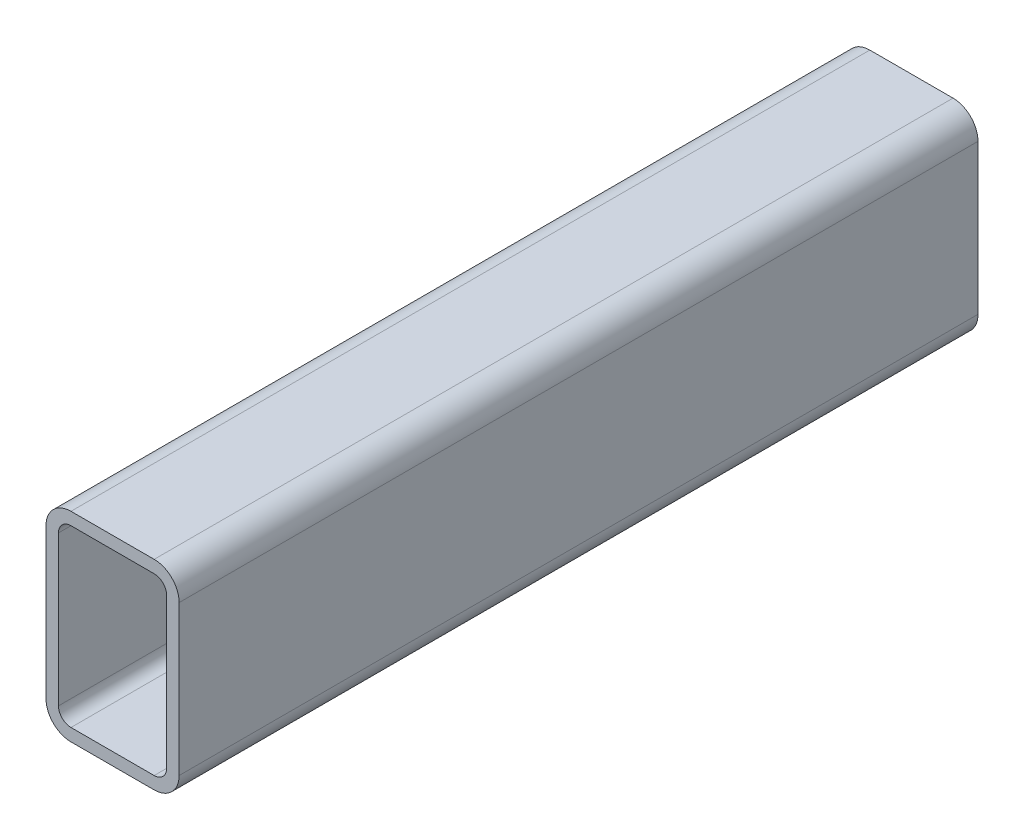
ISO-10303-21;
HEADER;
FILE_DESCRIPTION(('STEP AP214'),'2;1');
FILE_NAME('part.step','',(''),(''),'','','');
FILE_SCHEMA(('AUTOMOTIVE_DESIGN { 1 0 10303 214 1 1 1 1 }'));
ENDSEC;
DATA;
#1=APPLICATION_CONTEXT('core data for automotive mechanical design processes');
#2=APPLICATION_PROTOCOL_DEFINITION('international standard','automotive_design',2000,#1);
#3=PRODUCT_CONTEXT('',#1,'mechanical');
#4=PRODUCT('Part','Part','',(#3));
#5=PRODUCT_RELATED_PRODUCT_CATEGORY('part','',(#4));
#6=PRODUCT_DEFINITION_FORMATION('','',#4);
#7=PRODUCT_DEFINITION_CONTEXT('part definition',#1,'design');
#8=PRODUCT_DEFINITION('design','',#6,#7);
#9=PRODUCT_DEFINITION_SHAPE('','',#8);
#10=(LENGTH_UNIT() NAMED_UNIT(*) SI_UNIT(.MILLI.,.METRE.));
#11=(NAMED_UNIT(*) PLANE_ANGLE_UNIT() SI_UNIT($,.RADIAN.));
#12=(NAMED_UNIT(*) SI_UNIT($,.STERADIAN.) SOLID_ANGLE_UNIT());
#13=UNCERTAINTY_MEASURE_WITH_UNIT(LENGTH_MEASURE(1.E-05),#10,'distance_accuracy_value','');
#14=(GEOMETRIC_REPRESENTATION_CONTEXT(3) GLOBAL_UNCERTAINTY_ASSIGNED_CONTEXT((#13)) GLOBAL_UNIT_ASSIGNED_CONTEXT((#10,
#11,#12)) REPRESENTATION_CONTEXT('',''));
#15=CARTESIAN_POINT('',(0.,0.,0.));
#16=DIRECTION('',(0.,0.,1.));
#17=DIRECTION('',(1.,0.,0.));
#18=AXIS2_PLACEMENT_3D('',#15,#16,#17);
#19=CARTESIAN_POINT('',(9.525,66.675,304.8));
#20=DIRECTION('',(0.,0.,1.));
#21=DIRECTION('',(1.,0.,0.));
#22=AXIS2_PLACEMENT_3D('',#19,#20,#21);
#23=PLANE('',#22);
#24=CARTESIAN_POINT('',(9.525,66.675,304.8));
#25=DIRECTION('',(0.,0.,1.));
#26=DIRECTION('',(1.,0.,0.));
#27=AXIS2_PLACEMENT_3D('',#24,#25,#26);
#28=CIRCLE('',#27,9.52500000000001);
#29=CARTESIAN_POINT('',(9.525,76.2,304.8));
#30=VERTEX_POINT('',#29);
#31=CARTESIAN_POINT('',(0.,66.675,304.8));
#32=VERTEX_POINT('',#31);
#33=EDGE_CURVE('E211',#30,#32,#28,.T.);
#34=ORIENTED_EDGE('',*,*,#33,.T.);
#35=DIRECTION('',(0.,-1.,0.));
#36=VECTOR('',#35,1.);
#37=CARTESIAN_POINT('',(0.,9.525,304.8));
#38=LINE('',#37,#36);
#39=CARTESIAN_POINT('',(0.,9.525,304.8));
#40=VERTEX_POINT('',#39);
#41=EDGE_CURVE('E214',#32,#40,#38,.T.);
#42=ORIENTED_EDGE('',*,*,#41,.T.);
#43=CARTESIAN_POINT('',(9.525,9.525,304.8));
#44=DIRECTION('',(0.,0.,1.));
#45=DIRECTION('',(1.,0.,0.));
#46=AXIS2_PLACEMENT_3D('',#43,#44,#45);
#47=CIRCLE('',#46,9.525);
#48=CARTESIAN_POINT('',(9.525,0.,304.8));
#49=VERTEX_POINT('',#48);
#50=EDGE_CURVE('E217',#40,#49,#47,.T.);
#51=ORIENTED_EDGE('',*,*,#50,.T.);
#52=DIRECTION('',(1.,0.,0.));
#53=VECTOR('',#52,1.);
#54=CARTESIAN_POINT('',(41.275,0.,304.8));
#55=LINE('',#54,#53);
#56=CARTESIAN_POINT('',(41.275,0.,304.8));
#57=VERTEX_POINT('',#56);
#58=EDGE_CURVE('E219',#49,#57,#55,.T.);
#59=ORIENTED_EDGE('',*,*,#58,.T.);
#60=CARTESIAN_POINT('',(41.275,9.525,304.8));
#61=DIRECTION('',(0.,0.,1.));
#62=DIRECTION('',(1.,0.,0.));
#63=AXIS2_PLACEMENT_3D('',#60,#61,#62);
#64=CIRCLE('',#63,9.525);
#65=CARTESIAN_POINT('',(50.8,9.525,304.8));
#66=VERTEX_POINT('',#65);
#67=EDGE_CURVE('E221',#57,#66,#64,.T.);
#68=ORIENTED_EDGE('',*,*,#67,.T.);
#69=DIRECTION('',(0.,1.,0.));
#70=VECTOR('',#69,1.);
#71=CARTESIAN_POINT('',(50.8,66.675,304.8));
#72=LINE('',#71,#70);
#73=CARTESIAN_POINT('',(50.8,66.675,304.8));
#74=VERTEX_POINT('',#73);
#75=EDGE_CURVE('E223',#66,#74,#72,.T.);
#76=ORIENTED_EDGE('',*,*,#75,.T.);
#77=CARTESIAN_POINT('',(41.275,66.675,304.8));
#78=DIRECTION('',(0.,0.,1.));
#79=DIRECTION('',(1.,0.,0.));
#80=AXIS2_PLACEMENT_3D('',#77,#78,#79);
#81=CIRCLE('',#80,9.52500000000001);
#82=CARTESIAN_POINT('',(41.275,76.2,304.8));
#83=VERTEX_POINT('',#82);
#84=EDGE_CURVE('E225',#74,#83,#81,.T.);
#85=ORIENTED_EDGE('',*,*,#84,.T.);
#86=DIRECTION('',(-1.,0.,0.));
#87=VECTOR('',#86,1.);
#88=CARTESIAN_POINT('',(9.525,76.2,304.8));
#89=LINE('',#88,#87);
#90=EDGE_CURVE('E227',#83,#30,#89,.T.);
#91=ORIENTED_EDGE('',*,*,#90,.T.);
#92=EDGE_LOOP('',(#34,#42,#51,#59,#68,#76,#85,#91));
#93=FACE_BOUND('',#92,.T.);
#94=DIRECTION('',(0.,-1.,0.));
#95=VECTOR('',#94,1.);
#96=CARTESIAN_POINT('',(4.7625,9.525,304.8));
#97=LINE('',#96,#95);
#98=CARTESIAN_POINT('',(4.7625,66.675,304.8));
#99=VERTEX_POINT('',#98);
#100=CARTESIAN_POINT('',(4.7625,9.525,304.8));
#101=VERTEX_POINT('',#100);
#102=EDGE_CURVE('E154',#99,#101,#97,.T.);
#103=ORIENTED_EDGE('',*,*,#102,.F.);
#104=CARTESIAN_POINT('',(9.525,66.675,304.8));
#105=DIRECTION('',(0.,0.,1.));
#106=DIRECTION('',(1.,0.,0.));
#107=AXIS2_PLACEMENT_3D('',#104,#105,#106);
#108=CIRCLE('',#107,4.7625);
#109=CARTESIAN_POINT('',(9.525,71.4375,304.8));
#110=VERTEX_POINT('',#109);
#111=EDGE_CURVE('E146',#110,#99,#108,.T.);
#112=ORIENTED_EDGE('',*,*,#111,.F.);
#113=DIRECTION('',(-1.,0.,0.));
#114=VECTOR('',#113,1.);
#115=CARTESIAN_POINT('',(9.525,71.4375,304.8));
#116=LINE('',#115,#114);
#117=CARTESIAN_POINT('',(41.275,71.4375,304.8));
#118=VERTEX_POINT('',#117);
#119=EDGE_CURVE('E179',#118,#110,#116,.T.);
#120=ORIENTED_EDGE('',*,*,#119,.F.);
#121=CARTESIAN_POINT('',(41.275,66.675,304.8));
#122=DIRECTION('',(0.,0.,1.));
#123=DIRECTION('',(1.,0.,0.));
#124=AXIS2_PLACEMENT_3D('',#121,#122,#123);
#125=CIRCLE('',#124,4.7625);
#126=CARTESIAN_POINT('',(46.0375,66.675,304.8));
#127=VERTEX_POINT('',#126);
#128=EDGE_CURVE('E177',#127,#118,#125,.T.);
#129=ORIENTED_EDGE('',*,*,#128,.F.);
#130=DIRECTION('',(0.,1.,0.));
#131=VECTOR('',#130,1.);
#132=CARTESIAN_POINT('',(46.0375,66.675,304.8));
#133=LINE('',#132,#131);
#134=CARTESIAN_POINT('',(46.0375,9.525,304.8));
#135=VERTEX_POINT('',#134);
#136=EDGE_CURVE('E175',#135,#127,#133,.T.);
#137=ORIENTED_EDGE('',*,*,#136,.F.);
#138=CARTESIAN_POINT('',(41.275,9.525,304.8));
#139=DIRECTION('',(0.,0.,1.));
#140=DIRECTION('',(1.,0.,0.));
#141=AXIS2_PLACEMENT_3D('',#138,#139,#140);
#142=CIRCLE('',#141,4.7625);
#143=CARTESIAN_POINT('',(41.275,4.7625,304.8));
#144=VERTEX_POINT('',#143);
#145=EDGE_CURVE('E173',#144,#135,#142,.T.);
#146=ORIENTED_EDGE('',*,*,#145,.F.);
#147=DIRECTION('',(1.,0.,0.));
#148=VECTOR('',#147,1.);
#149=CARTESIAN_POINT('',(41.275,4.7625,304.8));
#150=LINE('',#149,#148);
#151=CARTESIAN_POINT('',(9.525,4.7625,304.8));
#152=VERTEX_POINT('',#151);
#153=EDGE_CURVE('E169',#152,#144,#150,.T.);
#154=ORIENTED_EDGE('',*,*,#153,.F.);
#155=CARTESIAN_POINT('',(9.525,9.525,304.8));
#156=DIRECTION('',(0.,0.,1.));
#157=DIRECTION('',(1.,0.,0.));
#158=AXIS2_PLACEMENT_3D('',#155,#156,#157);
#159=CIRCLE('',#158,4.7625);
#160=EDGE_CURVE('E167',#101,#152,#159,.T.);
#161=ORIENTED_EDGE('',*,*,#160,.F.);
#162=EDGE_LOOP('',(#103,#112,#120,#129,#137,#146,#154,#161));
#163=FACE_BOUND('',#162,.T.);
#164=ADVANCED_FACE('F33',(#93,#163),#23,.T.);
#165=CARTESIAN_POINT('',(9.525,66.675,0.));
#166=DIRECTION('',(0.,0.,1.));
#167=DIRECTION('',(1.,0.,0.));
#168=AXIS2_PLACEMENT_3D('',#165,#166,#167);
#169=PLANE('',#168);
#170=CARTESIAN_POINT('',(9.525,66.675,0.));
#171=DIRECTION('',(0.,0.,1.));
#172=DIRECTION('',(1.,0.,0.));
#173=AXIS2_PLACEMENT_3D('',#170,#171,#172);
#174=CIRCLE('',#173,9.52500000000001);
#175=CARTESIAN_POINT('',(9.525,76.2,0.));
#176=VERTEX_POINT('',#175);
#177=CARTESIAN_POINT('',(0.,66.675,0.));
#178=VERTEX_POINT('',#177);
#179=EDGE_CURVE('E162',#176,#178,#174,.T.);
#180=ORIENTED_EDGE('',*,*,#179,.F.);
#181=DIRECTION('',(-1.,0.,0.));
#182=VECTOR('',#181,1.);
#183=CARTESIAN_POINT('',(9.525,76.2,0.));
#184=LINE('',#183,#182);
#185=CARTESIAN_POINT('',(41.275,76.2,0.));
#186=VERTEX_POINT('',#185);
#187=EDGE_CURVE('E215',#186,#176,#184,.T.);
#188=ORIENTED_EDGE('',*,*,#187,.F.);
#189=CARTESIAN_POINT('',(41.275,66.675,0.));
#190=DIRECTION('',(0.,0.,1.));
#191=DIRECTION('',(1.,0.,0.));
#192=AXIS2_PLACEMENT_3D('',#189,#190,#191);
#193=CIRCLE('',#192,9.52500000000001);
#194=CARTESIAN_POINT('',(50.8,66.675,0.));
#195=VERTEX_POINT('',#194);
#196=EDGE_CURVE('E242',#195,#186,#193,.T.);
#197=ORIENTED_EDGE('',*,*,#196,.F.);
#198=DIRECTION('',(0.,1.,0.));
#199=VECTOR('',#198,1.);
#200=CARTESIAN_POINT('',(50.8,66.675,0.));
#201=LINE('',#200,#199);
#202=CARTESIAN_POINT('',(50.8,9.525,0.));
#203=VERTEX_POINT('',#202);
#204=EDGE_CURVE('E240',#203,#195,#201,.T.);
#205=ORIENTED_EDGE('',*,*,#204,.F.);
#206=CARTESIAN_POINT('',(41.275,9.525,0.));
#207=DIRECTION('',(0.,0.,1.));
#208=DIRECTION('',(1.,0.,0.));
#209=AXIS2_PLACEMENT_3D('',#206,#207,#208);
#210=CIRCLE('',#209,9.525);
#211=CARTESIAN_POINT('',(41.275,0.,0.));
#212=VERTEX_POINT('',#211);
#213=EDGE_CURVE('E238',#212,#203,#210,.T.);
#214=ORIENTED_EDGE('',*,*,#213,.F.);
#215=DIRECTION('',(1.,0.,0.));
#216=VECTOR('',#215,1.);
#217=CARTESIAN_POINT('',(41.275,0.,0.));
#218=LINE('',#217,#216);
#219=CARTESIAN_POINT('',(9.525,0.,0.));
#220=VERTEX_POINT('',#219);
#221=EDGE_CURVE('E236',#220,#212,#218,.T.);
#222=ORIENTED_EDGE('',*,*,#221,.F.);
#223=CARTESIAN_POINT('',(9.525,9.525,0.));
#224=DIRECTION('',(0.,0.,1.));
#225=DIRECTION('',(1.,0.,0.));
#226=AXIS2_PLACEMENT_3D('',#223,#224,#225);
#227=CIRCLE('',#226,9.525);
#228=CARTESIAN_POINT('',(0.,9.525,0.));
#229=VERTEX_POINT('',#228);
#230=EDGE_CURVE('E234',#229,#220,#227,.T.);
#231=ORIENTED_EDGE('',*,*,#230,.F.);
#232=DIRECTION('',(0.,-1.,0.));
#233=VECTOR('',#232,1.);
#234=CARTESIAN_POINT('',(0.,9.525,0.));
#235=LINE('',#234,#233);
#236=EDGE_CURVE('E232',#178,#229,#235,.T.);
#237=ORIENTED_EDGE('',*,*,#236,.F.);
#238=EDGE_LOOP('',(#180,#188,#197,#205,#214,#222,#231,#237));
#239=FACE_BOUND('',#238,.T.);
#240=CARTESIAN_POINT('',(9.525,66.675,0.));
#241=DIRECTION('',(0.,0.,1.));
#242=DIRECTION('',(1.,0.,0.));
#243=AXIS2_PLACEMENT_3D('',#240,#241,#242);
#244=CIRCLE('',#243,4.7625);
#245=CARTESIAN_POINT('',(9.525,71.4375,0.));
#246=VERTEX_POINT('',#245);
#247=CARTESIAN_POINT('',(4.7625,66.675,0.));
#248=VERTEX_POINT('',#247);
#249=EDGE_CURVE('E56',#246,#248,#244,.T.);
#250=ORIENTED_EDGE('',*,*,#249,.T.);
#251=DIRECTION('',(0.,-1.,0.));
#252=VECTOR('',#251,1.);
#253=CARTESIAN_POINT('',(4.7625,9.525,0.));
#254=LINE('',#253,#252);
#255=CARTESIAN_POINT('',(4.7625,9.525,0.));
#256=VERTEX_POINT('',#255);
#257=EDGE_CURVE('E161',#248,#256,#254,.T.);
#258=ORIENTED_EDGE('',*,*,#257,.T.);
#259=CARTESIAN_POINT('',(9.525,9.525,0.));
#260=DIRECTION('',(0.,0.,1.));
#261=DIRECTION('',(1.,0.,0.));
#262=AXIS2_PLACEMENT_3D('',#259,#260,#261);
#263=CIRCLE('',#262,4.7625);
#264=CARTESIAN_POINT('',(9.525,4.7625,0.));
#265=VERTEX_POINT('',#264);
#266=EDGE_CURVE('E183',#256,#265,#263,.T.);
#267=ORIENTED_EDGE('',*,*,#266,.T.);
#268=DIRECTION('',(1.,0.,0.));
#269=VECTOR('',#268,1.);
#270=CARTESIAN_POINT('',(41.275,4.7625,0.));
#271=LINE('',#270,#269);
#272=CARTESIAN_POINT('',(41.275,4.7625,0.));
#273=VERTEX_POINT('',#272);
#274=EDGE_CURVE('E186',#265,#273,#271,.T.);
#275=ORIENTED_EDGE('',*,*,#274,.T.);
#276=CARTESIAN_POINT('',(41.275,9.525,0.));
#277=DIRECTION('',(0.,0.,1.));
#278=DIRECTION('',(1.,0.,0.));
#279=AXIS2_PLACEMENT_3D('',#276,#277,#278);
#280=CIRCLE('',#279,4.7625);
#281=CARTESIAN_POINT('',(46.0375,9.525,0.));
#282=VERTEX_POINT('',#281);
#283=EDGE_CURVE('E189',#273,#282,#280,.T.);
#284=ORIENTED_EDGE('',*,*,#283,.T.);
#285=DIRECTION('',(0.,1.,0.));
#286=VECTOR('',#285,1.);
#287=CARTESIAN_POINT('',(46.0375,66.675,0.));
#288=LINE('',#287,#286);
#289=CARTESIAN_POINT('',(46.0375,66.675,0.));
#290=VERTEX_POINT('',#289);
#291=EDGE_CURVE('E192',#282,#290,#288,.T.);
#292=ORIENTED_EDGE('',*,*,#291,.T.);
#293=CARTESIAN_POINT('',(41.275,66.675,0.));
#294=DIRECTION('',(0.,0.,1.));
#295=DIRECTION('',(1.,0.,0.));
#296=AXIS2_PLACEMENT_3D('',#293,#294,#295);
#297=CIRCLE('',#296,4.7625);
#298=CARTESIAN_POINT('',(41.275,71.4375,0.));
#299=VERTEX_POINT('',#298);
#300=EDGE_CURVE('E195',#290,#299,#297,.T.);
#301=ORIENTED_EDGE('',*,*,#300,.T.);
#302=DIRECTION('',(-1.,0.,0.));
#303=VECTOR('',#302,1.);
#304=CARTESIAN_POINT('',(9.525,71.4375,0.));
#305=LINE('',#304,#303);
#306=EDGE_CURVE('E155',#299,#246,#305,.T.);
#307=ORIENTED_EDGE('',*,*,#306,.T.);
#308=EDGE_LOOP('',(#250,#258,#267,#275,#284,#292,#301,#307));
#309=FACE_BOUND('',#308,.T.);
#310=ADVANCED_FACE('F272',(#239,#309),#169,.F.);
#311=CARTESIAN_POINT('',(9.525,66.675,304.8));
#312=DIRECTION('',(0.,0.,-1.));
#313=DIRECTION('',(-1.,0.,0.));
#314=AXIS2_PLACEMENT_3D('',#311,#312,#313);
#315=CYLINDRICAL_SURFACE('',#314,9.52500000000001);
#316=ORIENTED_EDGE('',*,*,#179,.T.);
#317=DIRECTION('',(0.,0.,-1.));
#318=VECTOR('',#317,1.);
#319=CARTESIAN_POINT('',(0.,66.675,304.8));
#320=LINE('',#319,#318);
#321=EDGE_CURVE('E11',#32,#178,#320,.T.);
#322=ORIENTED_EDGE('',*,*,#321,.F.);
#323=ORIENTED_EDGE('',*,*,#33,.F.);
#324=DIRECTION('',(0.,0.,-1.));
#325=VECTOR('',#324,1.);
#326=CARTESIAN_POINT('',(9.525,76.2,304.8));
#327=LINE('',#326,#325);
#328=EDGE_CURVE('E229',#30,#176,#327,.T.);
#329=ORIENTED_EDGE('',*,*,#328,.T.);
#330=EDGE_LOOP('',(#316,#322,#323,#329));
#331=FACE_BOUND('',#330,.T.);
#332=ADVANCED_FACE('F35',(#331),#315,.T.);
#333=CARTESIAN_POINT('',(0.,9.525,304.8));
#334=DIRECTION('',(1.,0.,0.));
#335=DIRECTION('',(0.,0.,-1.));
#336=AXIS2_PLACEMENT_3D('',#333,#334,#335);
#337=PLANE('',#336);
#338=ORIENTED_EDGE('',*,*,#236,.T.);
#339=DIRECTION('',(0.,0.,-1.));
#340=VECTOR('',#339,1.);
#341=CARTESIAN_POINT('',(0.,9.525,304.8));
#342=LINE('',#341,#340);
#343=EDGE_CURVE('E41',#40,#229,#342,.T.);
#344=ORIENTED_EDGE('',*,*,#343,.F.);
#345=ORIENTED_EDGE('',*,*,#41,.F.);
#346=ORIENTED_EDGE('',*,*,#321,.T.);
#347=EDGE_LOOP('',(#338,#344,#345,#346));
#348=FACE_BOUND('',#347,.T.);
#349=ADVANCED_FACE('F289',(#348),#337,.F.);
#350=CARTESIAN_POINT('',(9.525,9.525,304.8));
#351=DIRECTION('',(0.,0.,-1.));
#352=DIRECTION('',(-1.,0.,0.));
#353=AXIS2_PLACEMENT_3D('',#350,#351,#352);
#354=CYLINDRICAL_SURFACE('',#353,9.525);
#355=ORIENTED_EDGE('',*,*,#230,.T.);
#356=DIRECTION('',(0.,0.,-1.));
#357=VECTOR('',#356,1.);
#358=CARTESIAN_POINT('',(9.525,0.,304.8));
#359=LINE('',#358,#357);
#360=EDGE_CURVE('E259',#49,#220,#359,.T.);
#361=ORIENTED_EDGE('',*,*,#360,.F.);
#362=ORIENTED_EDGE('',*,*,#50,.F.);
#363=ORIENTED_EDGE('',*,*,#343,.T.);
#364=EDGE_LOOP('',(#355,#361,#362,#363));
#365=FACE_BOUND('',#364,.T.);
#366=ADVANCED_FACE('F266',(#365),#354,.T.);
#367=CARTESIAN_POINT('',(41.275,0.,304.8));
#368=DIRECTION('',(0.,1.,0.));
#369=DIRECTION('',(0.,0.,1.));
#370=AXIS2_PLACEMENT_3D('',#367,#368,#369);
#371=PLANE('',#370);
#372=ORIENTED_EDGE('',*,*,#221,.T.);
#373=DIRECTION('',(0.,0.,-1.));
#374=VECTOR('',#373,1.);
#375=CARTESIAN_POINT('',(41.275,0.,304.8));
#376=LINE('',#375,#374);
#377=EDGE_CURVE('E256',#57,#212,#376,.T.);
#378=ORIENTED_EDGE('',*,*,#377,.F.);
#379=ORIENTED_EDGE('',*,*,#58,.F.);
#380=ORIENTED_EDGE('',*,*,#360,.T.);
#381=EDGE_LOOP('',(#372,#378,#379,#380));
#382=FACE_BOUND('',#381,.T.);
#383=ADVANCED_FACE('F278',(#382),#371,.F.);
#384=CARTESIAN_POINT('',(41.275,9.525,304.8));
#385=DIRECTION('',(0.,0.,-1.));
#386=DIRECTION('',(-1.,0.,0.));
#387=AXIS2_PLACEMENT_3D('',#384,#385,#386);
#388=CYLINDRICAL_SURFACE('',#387,9.525);
#389=ORIENTED_EDGE('',*,*,#213,.T.);
#390=DIRECTION('',(0.,0.,-1.));
#391=VECTOR('',#390,1.);
#392=CARTESIAN_POINT('',(50.8,9.525,304.8));
#393=LINE('',#392,#391);
#394=EDGE_CURVE('E253',#66,#203,#393,.T.);
#395=ORIENTED_EDGE('',*,*,#394,.F.);
#396=ORIENTED_EDGE('',*,*,#67,.F.);
#397=ORIENTED_EDGE('',*,*,#377,.T.);
#398=EDGE_LOOP('',(#389,#395,#396,#397));
#399=FACE_BOUND('',#398,.T.);
#400=ADVANCED_FACE('F282',(#399),#388,.T.);
#401=CARTESIAN_POINT('',(50.8,66.675,304.8));
#402=DIRECTION('',(-1.,0.,0.));
#403=DIRECTION('',(0.,0.,1.));
#404=AXIS2_PLACEMENT_3D('',#401,#402,#403);
#405=PLANE('',#404);
#406=ORIENTED_EDGE('',*,*,#204,.T.);
#407=DIRECTION('',(0.,0.,-1.));
#408=VECTOR('',#407,1.);
#409=CARTESIAN_POINT('',(50.8,66.675,304.8));
#410=LINE('',#409,#408);
#411=EDGE_CURVE('E250',#74,#195,#410,.T.);
#412=ORIENTED_EDGE('',*,*,#411,.F.);
#413=ORIENTED_EDGE('',*,*,#75,.F.);
#414=ORIENTED_EDGE('',*,*,#394,.T.);
#415=EDGE_LOOP('',(#406,#412,#413,#414));
#416=FACE_BOUND('',#415,.T.);
#417=ADVANCED_FACE('F302',(#416),#405,.F.);
#418=CARTESIAN_POINT('',(41.275,66.675,304.8));
#419=DIRECTION('',(0.,0.,-1.));
#420=DIRECTION('',(-1.,0.,0.));
#421=AXIS2_PLACEMENT_3D('',#418,#419,#420);
#422=CYLINDRICAL_SURFACE('',#421,9.52500000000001);
#423=ORIENTED_EDGE('',*,*,#196,.T.);
#424=DIRECTION('',(0.,0.,-1.));
#425=VECTOR('',#424,1.);
#426=CARTESIAN_POINT('',(41.275,76.2,304.8));
#427=LINE('',#426,#425);
#428=EDGE_CURVE('E247',#83,#186,#427,.T.);
#429=ORIENTED_EDGE('',*,*,#428,.F.);
#430=ORIENTED_EDGE('',*,*,#84,.F.);
#431=ORIENTED_EDGE('',*,*,#411,.T.);
#432=EDGE_LOOP('',(#423,#429,#430,#431));
#433=FACE_BOUND('',#432,.T.);
#434=ADVANCED_FACE('F300',(#433),#422,.T.);
#435=CARTESIAN_POINT('',(9.525,76.2,304.8));
#436=DIRECTION('',(0.,-1.,0.));
#437=DIRECTION('',(0.,0.,-1.));
#438=AXIS2_PLACEMENT_3D('',#435,#436,#437);
#439=PLANE('',#438);
#440=ORIENTED_EDGE('',*,*,#187,.T.);
#441=ORIENTED_EDGE('',*,*,#328,.F.);
#442=ORIENTED_EDGE('',*,*,#90,.F.);
#443=ORIENTED_EDGE('',*,*,#428,.T.);
#444=EDGE_LOOP('',(#440,#441,#442,#443));
#445=FACE_BOUND('',#444,.T.);
#446=ADVANCED_FACE('F295',(#445),#439,.F.);
#447=CARTESIAN_POINT('',(9.525,66.675,304.8));
#448=DIRECTION('',(0.,0.,-1.));
#449=DIRECTION('',(-1.,0.,0.));
#450=AXIS2_PLACEMENT_3D('',#447,#448,#449);
#451=CYLINDRICAL_SURFACE('',#450,4.7625);
#452=ORIENTED_EDGE('',*,*,#249,.F.);
#453=DIRECTION('',(0.,0.,-1.));
#454=VECTOR('',#453,1.);
#455=CARTESIAN_POINT('',(9.525,71.4375,304.8));
#456=LINE('',#455,#454);
#457=EDGE_CURVE('E150',#110,#246,#456,.T.);
#458=ORIENTED_EDGE('',*,*,#457,.F.);
#459=ORIENTED_EDGE('',*,*,#111,.T.);
#460=DIRECTION('',(0.,0.,-1.));
#461=VECTOR('',#460,1.);
#462=CARTESIAN_POINT('',(4.7625,66.675,304.8));
#463=LINE('',#462,#461);
#464=EDGE_CURVE('E149',#99,#248,#463,.T.);
#465=ORIENTED_EDGE('',*,*,#464,.T.);
#466=EDGE_LOOP('',(#452,#458,#459,#465));
#467=FACE_BOUND('',#466,.T.);
#468=ADVANCED_FACE('F148',(#467),#451,.F.);
#469=CARTESIAN_POINT('',(4.7625,9.525,304.8));
#470=DIRECTION('',(1.,0.,0.));
#471=DIRECTION('',(0.,0.,-1.));
#472=AXIS2_PLACEMENT_3D('',#469,#470,#471);
#473=PLANE('',#472);
#474=ORIENTED_EDGE('',*,*,#257,.F.);
#475=ORIENTED_EDGE('',*,*,#464,.F.);
#476=ORIENTED_EDGE('',*,*,#102,.T.);
#477=DIRECTION('',(0.,0.,-1.));
#478=VECTOR('',#477,1.);
#479=CARTESIAN_POINT('',(4.7625,9.525,304.8));
#480=LINE('',#479,#478);
#481=EDGE_CURVE('E163',#101,#256,#480,.T.);
#482=ORIENTED_EDGE('',*,*,#481,.T.);
#483=EDGE_LOOP('',(#474,#475,#476,#482));
#484=FACE_BOUND('',#483,.T.);
#485=ADVANCED_FACE('F158',(#484),#473,.T.);
#486=CARTESIAN_POINT('',(9.525,9.525,304.8));
#487=DIRECTION('',(0.,0.,-1.));
#488=DIRECTION('',(-1.,0.,0.));
#489=AXIS2_PLACEMENT_3D('',#486,#487,#488);
#490=CYLINDRICAL_SURFACE('',#489,4.7625);
#491=ORIENTED_EDGE('',*,*,#266,.F.);
#492=ORIENTED_EDGE('',*,*,#481,.F.);
#493=ORIENTED_EDGE('',*,*,#160,.T.);
#494=DIRECTION('',(0.,0.,-1.));
#495=VECTOR('',#494,1.);
#496=CARTESIAN_POINT('',(9.525,4.7625,304.8));
#497=LINE('',#496,#495);
#498=EDGE_CURVE('E208',#152,#265,#497,.T.);
#499=ORIENTED_EDGE('',*,*,#498,.T.);
#500=EDGE_LOOP('',(#491,#492,#493,#499));
#501=FACE_BOUND('',#500,.T.);
#502=ADVANCED_FACE('F327',(#501),#490,.F.);
#503=CARTESIAN_POINT('',(41.275,4.7625,304.8));
#504=DIRECTION('',(0.,1.,0.));
#505=DIRECTION('',(0.,0.,1.));
#506=AXIS2_PLACEMENT_3D('',#503,#504,#505);
#507=PLANE('',#506);
#508=ORIENTED_EDGE('',*,*,#274,.F.);
#509=ORIENTED_EDGE('',*,*,#498,.F.);
#510=ORIENTED_EDGE('',*,*,#153,.T.);
#511=DIRECTION('',(0.,0.,-1.));
#512=VECTOR('',#511,1.);
#513=CARTESIAN_POINT('',(41.275,4.7625,304.8));
#514=LINE('',#513,#512);
#515=EDGE_CURVE('E206',#144,#273,#514,.T.);
#516=ORIENTED_EDGE('',*,*,#515,.T.);
#517=EDGE_LOOP('',(#508,#509,#510,#516));
#518=FACE_BOUND('',#517,.T.);
#519=ADVANCED_FACE('F331',(#518),#507,.T.);
#520=CARTESIAN_POINT('',(41.275,9.525,304.8));
#521=DIRECTION('',(0.,0.,-1.));
#522=DIRECTION('',(-1.,0.,0.));
#523=AXIS2_PLACEMENT_3D('',#520,#521,#522);
#524=CYLINDRICAL_SURFACE('',#523,4.7625);
#525=ORIENTED_EDGE('',*,*,#283,.F.);
#526=ORIENTED_EDGE('',*,*,#515,.F.);
#527=ORIENTED_EDGE('',*,*,#145,.T.);
#528=DIRECTION('',(0.,0.,-1.));
#529=VECTOR('',#528,1.);
#530=CARTESIAN_POINT('',(46.0375,9.525,304.8));
#531=LINE('',#530,#529);
#532=EDGE_CURVE('E204',#135,#282,#531,.T.);
#533=ORIENTED_EDGE('',*,*,#532,.T.);
#534=EDGE_LOOP('',(#525,#526,#527,#533));
#535=FACE_BOUND('',#534,.T.);
#536=ADVANCED_FACE('F337',(#535),#524,.F.);
#537=CARTESIAN_POINT('',(46.0375,66.675,304.8));
#538=DIRECTION('',(-1.,0.,0.));
#539=DIRECTION('',(0.,0.,1.));
#540=AXIS2_PLACEMENT_3D('',#537,#538,#539);
#541=PLANE('',#540);
#542=ORIENTED_EDGE('',*,*,#291,.F.);
#543=ORIENTED_EDGE('',*,*,#532,.F.);
#544=ORIENTED_EDGE('',*,*,#136,.T.);
#545=DIRECTION('',(0.,0.,-1.));
#546=VECTOR('',#545,1.);
#547=CARTESIAN_POINT('',(46.0375,66.675,304.8));
#548=LINE('',#547,#546);
#549=EDGE_CURVE('E202',#127,#290,#548,.T.);
#550=ORIENTED_EDGE('',*,*,#549,.T.);
#551=EDGE_LOOP('',(#542,#543,#544,#550));
#552=FACE_BOUND('',#551,.T.);
#553=ADVANCED_FACE('F341',(#552),#541,.T.);
#554=CARTESIAN_POINT('',(41.275,66.675,304.8));
#555=DIRECTION('',(0.,0.,-1.));
#556=DIRECTION('',(-1.,0.,0.));
#557=AXIS2_PLACEMENT_3D('',#554,#555,#556);
#558=CYLINDRICAL_SURFACE('',#557,4.7625);
#559=ORIENTED_EDGE('',*,*,#300,.F.);
#560=ORIENTED_EDGE('',*,*,#549,.F.);
#561=ORIENTED_EDGE('',*,*,#128,.T.);
#562=DIRECTION('',(0.,0.,-1.));
#563=VECTOR('',#562,1.);
#564=CARTESIAN_POINT('',(41.275,71.4375,304.8));
#565=LINE('',#564,#563);
#566=EDGE_CURVE('E48',#118,#299,#565,.T.);
#567=ORIENTED_EDGE('',*,*,#566,.T.);
#568=EDGE_LOOP('',(#559,#560,#561,#567));
#569=FACE_BOUND('',#568,.T.);
#570=ADVANCED_FACE('F345',(#569),#558,.F.);
#571=CARTESIAN_POINT('',(9.525,71.4375,304.8));
#572=DIRECTION('',(0.,-1.,0.));
#573=DIRECTION('',(0.,0.,-1.));
#574=AXIS2_PLACEMENT_3D('',#571,#572,#573);
#575=PLANE('',#574);
#576=ORIENTED_EDGE('',*,*,#306,.F.);
#577=ORIENTED_EDGE('',*,*,#566,.F.);
#578=ORIENTED_EDGE('',*,*,#119,.T.);
#579=ORIENTED_EDGE('',*,*,#457,.T.);
#580=EDGE_LOOP('',(#576,#577,#578,#579));
#581=FACE_BOUND('',#580,.T.);
#582=ADVANCED_FACE('F349',(#581),#575,.T.);
#583=CLOSED_SHELL('',(#164,#310,#332,#349,#366,#383,#400,#417,#434,#446,#468,#485,#502,#519,
#536,#553,#570,#582));
#584=MANIFOLD_SOLID_BREP('B2',#583);
#585=ADVANCED_BREP_SHAPE_REPRESENTATION('',(#18,#584),#14);
#586=SHAPE_DEFINITION_REPRESENTATION(#9,#585);
ENDSEC;
END-ISO-10303-21;
